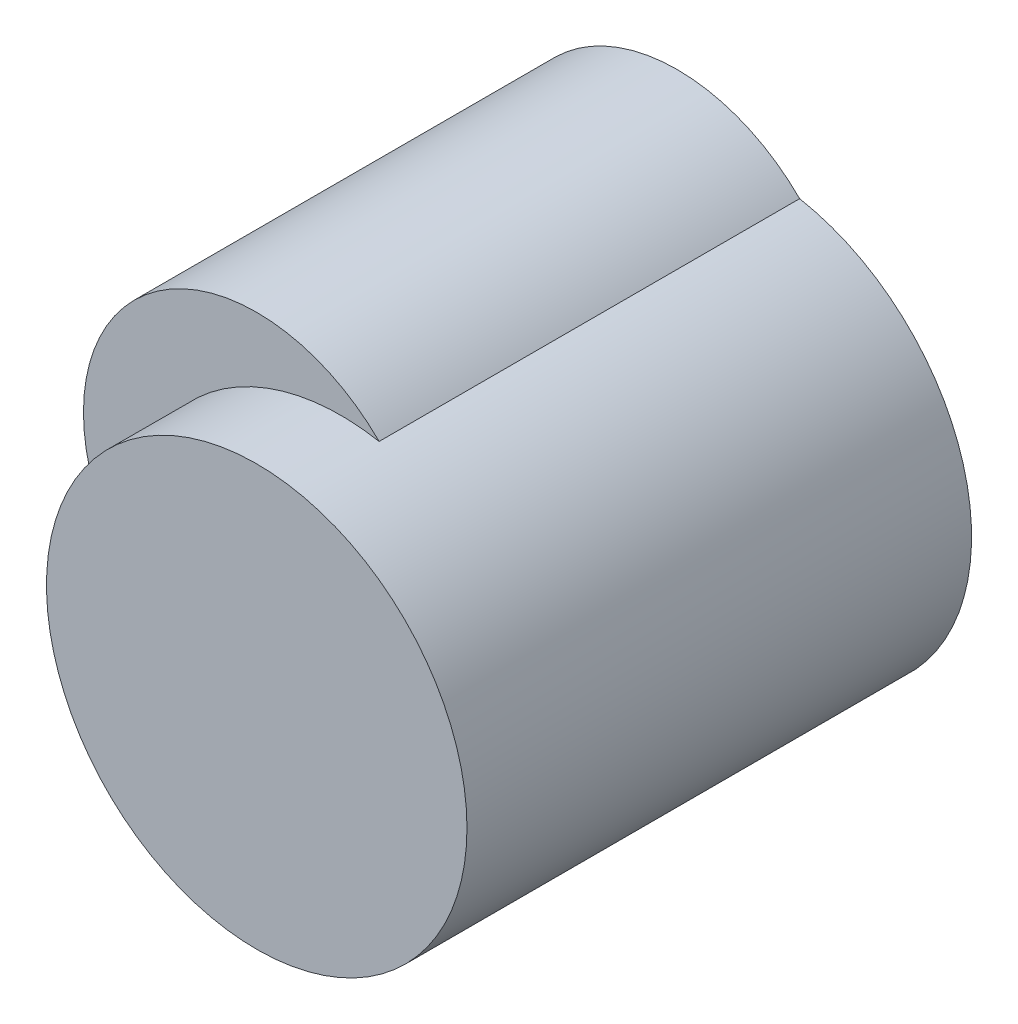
ISO-10303-21;
HEADER;
FILE_DESCRIPTION(('STEP AP214'),'2;1');
FILE_NAME('part.step','',(''),(''),'','','');
FILE_SCHEMA(('AUTOMOTIVE_DESIGN { 1 0 10303 214 1 1 1 1 }'));
ENDSEC;
DATA;
#1=APPLICATION_CONTEXT('core data for automotive mechanical design processes');
#2=APPLICATION_PROTOCOL_DEFINITION('international standard','automotive_design',2000,#1);
#3=PRODUCT_CONTEXT('',#1,'mechanical');
#4=PRODUCT('Part','Part','',(#3));
#5=PRODUCT_RELATED_PRODUCT_CATEGORY('part','',(#4));
#6=PRODUCT_DEFINITION_FORMATION('','',#4);
#7=PRODUCT_DEFINITION_CONTEXT('part definition',#1,'design');
#8=PRODUCT_DEFINITION('design','',#6,#7);
#9=PRODUCT_DEFINITION_SHAPE('','',#8);
#10=(LENGTH_UNIT() NAMED_UNIT(*) SI_UNIT(.MILLI.,.METRE.));
#11=(NAMED_UNIT(*) PLANE_ANGLE_UNIT() SI_UNIT($,.RADIAN.));
#12=(NAMED_UNIT(*) SI_UNIT($,.STERADIAN.) SOLID_ANGLE_UNIT());
#13=UNCERTAINTY_MEASURE_WITH_UNIT(LENGTH_MEASURE(1.E-05),#10,'distance_accuracy_value','');
#14=(GEOMETRIC_REPRESENTATION_CONTEXT(3) GLOBAL_UNCERTAINTY_ASSIGNED_CONTEXT((#13)) GLOBAL_UNIT_ASSIGNED_CONTEXT((#10,
#11,#12)) REPRESENTATION_CONTEXT('',''));
#15=CARTESIAN_POINT('',(0.,0.,0.));
#16=DIRECTION('',(0.,0.,1.));
#17=DIRECTION('',(1.,0.,0.));
#18=AXIS2_PLACEMENT_3D('',#15,#16,#17);
#19=CARTESIAN_POINT('',(0.,0.,60.));
#20=DIRECTION('',(0.,0.,-1.));
#21=DIRECTION('',(-1.,0.,0.));
#22=AXIS2_PLACEMENT_3D('',#19,#20,#21);
#23=CYLINDRICAL_SURFACE('',#22,25.);
#24=CARTESIAN_POINT('',(0.,0.,60.));
#25=DIRECTION('',(0.,0.,1.));
#26=DIRECTION('',(1.,0.,0.));
#27=AXIS2_PLACEMENT_3D('',#24,#25,#26);
#28=CIRCLE('',#27,25.);
#29=CARTESIAN_POINT('',(25.,0.,60.));
#30=VERTEX_POINT('',#29);
#31=EDGE_CURVE('E38',#30,#30,#28,.T.);
#32=ORIENTED_EDGE('',*,*,#31,.F.);
#33=EDGE_LOOP('',(#32));
#34=FACE_BOUND('',#33,.T.);
#35=DIRECTION('',(0.,0.,-1.));
#36=VECTOR('',#35,1.);
#37=CARTESIAN_POINT('',(4.55458352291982,24.5816144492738,25.));
#38=LINE('',#37,#36);
#39=CARTESIAN_POINT('',(4.55458352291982,24.5816144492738,50.));
#40=VERTEX_POINT('',#39);
#41=CARTESIAN_POINT('',(4.55458352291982,24.5816144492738,0.));
#42=VERTEX_POINT('',#41);
#43=EDGE_CURVE('E48',#40,#42,#38,.T.);
#44=ORIENTED_EDGE('',*,*,#43,.F.);
#45=CARTESIAN_POINT('',(0.,0.,50.));
#46=DIRECTION('',(0.,0.,1.));
#47=DIRECTION('',(1.,0.,0.));
#48=AXIS2_PLACEMENT_3D('',#45,#46,#47);
#49=CIRCLE('',#48,25.);
#50=CARTESIAN_POINT('',(-24.5816144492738,-4.55458352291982,50.));
#51=VERTEX_POINT('',#50);
#52=EDGE_CURVE('E11',#40,#51,#49,.T.);
#53=ORIENTED_EDGE('',*,*,#52,.T.);
#54=DIRECTION('',(0.,0.,-1.));
#55=VECTOR('',#54,1.);
#56=CARTESIAN_POINT('',(-24.5816144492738,-4.55458352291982,25.));
#57=LINE('',#56,#55);
#58=CARTESIAN_POINT('',(-24.5816144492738,-4.55458352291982,0.));
#59=VERTEX_POINT('',#58);
#60=EDGE_CURVE('E59',#59,#51,#57,.F.);
#61=ORIENTED_EDGE('',*,*,#60,.F.);
#62=CARTESIAN_POINT('',(0.,0.,0.));
#63=DIRECTION('',(0.,0.,1.));
#64=DIRECTION('',(1.,0.,0.));
#65=AXIS2_PLACEMENT_3D('',#62,#63,#64);
#66=CIRCLE('',#65,25.);
#67=EDGE_CURVE('E55',#59,#42,#66,.T.);
#68=ORIENTED_EDGE('',*,*,#67,.T.);
#69=EDGE_LOOP('',(#44,#53,#61,#68));
#70=FACE_BOUND('',#69,.T.);
#71=ADVANCED_FACE('F31',(#34,#70),#23,.T.);
#72=CARTESIAN_POINT('',(0.,0.,60.));
#73=DIRECTION('',(0.,0.,1.));
#74=DIRECTION('',(1.,0.,0.));
#75=AXIS2_PLACEMENT_3D('',#72,#73,#74);
#76=PLANE('',#75);
#77=ORIENTED_EDGE('',*,*,#31,.T.);
#78=EDGE_LOOP('',(#77));
#79=FACE_BOUND('',#78,.T.);
#80=ADVANCED_FACE('F73',(#79),#76,.T.);
#81=CARTESIAN_POINT('',(0.,0.,0.));
#82=DIRECTION('',(0.,0.,1.));
#83=DIRECTION('',(1.,0.,0.));
#84=AXIS2_PLACEMENT_3D('',#81,#82,#83);
#85=PLANE('',#84);
#86=ORIENTED_EDGE('',*,*,#67,.F.);
#87=CARTESIAN_POINT('',(-10.,10.,0.));
#88=DIRECTION('',(0.,0.,1.));
#89=DIRECTION('',(1.,0.,0.));
#90=AXIS2_PLACEMENT_3D('',#87,#88,#89);
#91=CIRCLE('',#90,20.6024120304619);
#92=EDGE_CURVE('E58',#42,#59,#91,.T.);
#93=ORIENTED_EDGE('',*,*,#92,.F.);
#94=EDGE_LOOP('',(#86,#93));
#95=FACE_BOUND('',#94,.T.);
#96=ADVANCED_FACE('F56',(#95),#85,.F.);
#97=CARTESIAN_POINT('',(-10.,10.,50.));
#98=DIRECTION('',(0.,0.,1.));
#99=DIRECTION('',(1.,0.,0.));
#100=AXIS2_PLACEMENT_3D('',#97,#98,#99);
#101=PLANE('',#100);
#102=ORIENTED_EDGE('',*,*,#52,.F.);
#103=CARTESIAN_POINT('',(-10.,10.,50.));
#104=DIRECTION('',(0.,0.,1.));
#105=DIRECTION('',(1.,0.,0.));
#106=AXIS2_PLACEMENT_3D('',#103,#104,#105);
#107=CIRCLE('',#106,20.6024120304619);
#108=EDGE_CURVE('E63',#40,#51,#107,.T.);
#109=ORIENTED_EDGE('',*,*,#108,.T.);
#110=EDGE_LOOP('',(#102,#109));
#111=FACE_BOUND('',#110,.T.);
#112=ADVANCED_FACE('F83',(#111),#101,.T.);
#113=CARTESIAN_POINT('',(-10.,10.,50.));
#114=DIRECTION('',(0.,0.,-1.));
#115=DIRECTION('',(-1.,0.,0.));
#116=AXIS2_PLACEMENT_3D('',#113,#114,#115);
#117=CYLINDRICAL_SURFACE('',#116,20.6024120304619);
#118=ORIENTED_EDGE('',*,*,#108,.F.);
#119=ORIENTED_EDGE('',*,*,#43,.T.);
#120=ORIENTED_EDGE('',*,*,#92,.T.);
#121=ORIENTED_EDGE('',*,*,#60,.T.);
#122=EDGE_LOOP('',(#118,#119,#120,#121));
#123=FACE_BOUND('',#122,.T.);
#124=ADVANCED_FACE('F65',(#123),#117,.T.);
#125=CLOSED_SHELL('',(#71,#80,#96,#112,#124));
#126=MANIFOLD_SOLID_BREP('B2',#125);
#127=ADVANCED_BREP_SHAPE_REPRESENTATION('',(#18,#126),#14);
#128=SHAPE_DEFINITION_REPRESENTATION(#9,#127);
ENDSEC;
END-ISO-10303-21;
